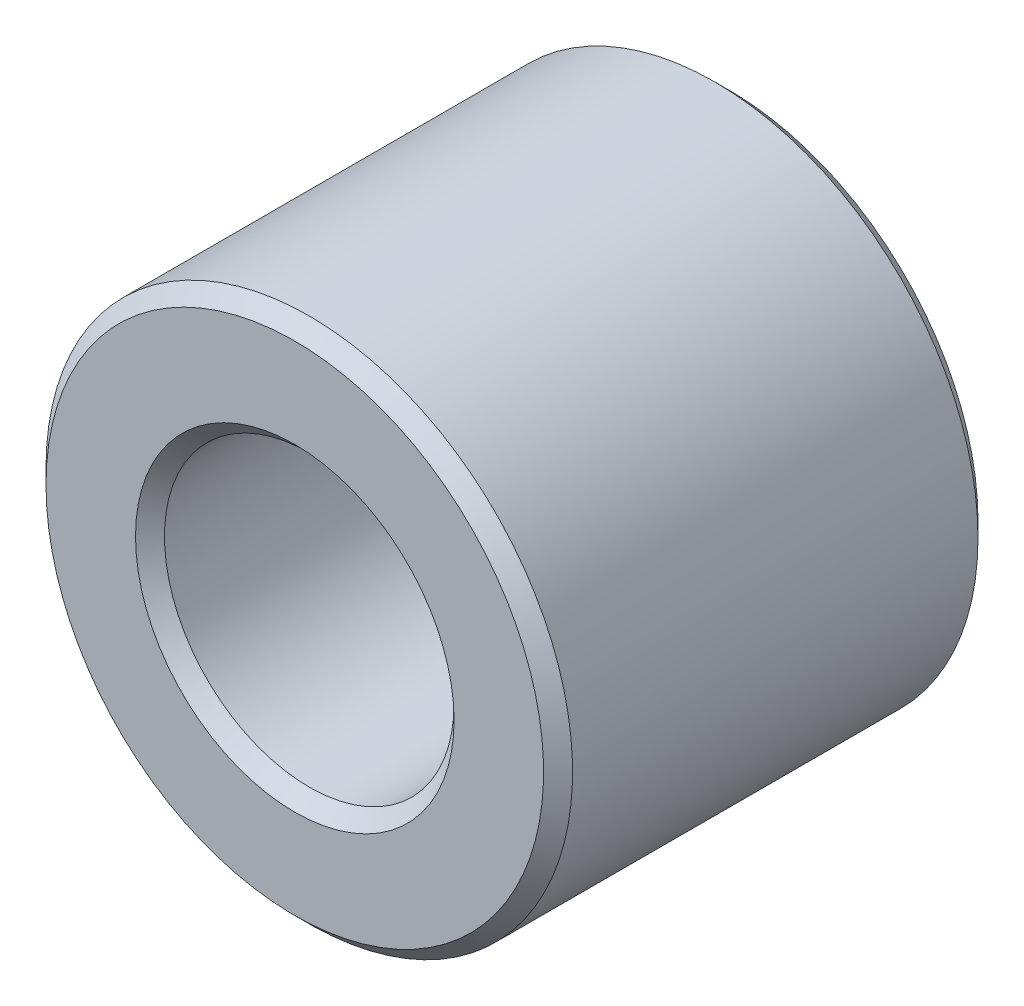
from build123d import *

# Parameters (mm, degrees)
SKETCH1_R           = 40
SKETCH1_R_2         = 22
BOSS_EXTRUDE1_DEPTH = 33
CHAMFER1_SIZE       = 2.2


with BuildPart() as part:
    # Sketch1 → Boss-Extrude1 (new, symmetric)
    with BuildSketch(Plane.XY):
        Circle(SKETCH1_R)
        Circle(SKETCH1_R_2, mode=Mode.SUBTRACT)
    extrude(amount=BOSS_EXTRUDE1_DEPTH, both=True)

    # Chamfer1
    chamfer1_edges = [part.edges().sort_by_distance(p)[0] for p in [
        (-40, 0, -33),
        (-40, 0, 33),
        (-22, 0, -33),
        (-22, 0, 33),
    ]]
    chamfer(chamfer1_edges, length=CHAMFER1_SIZE)


solid = part.part
